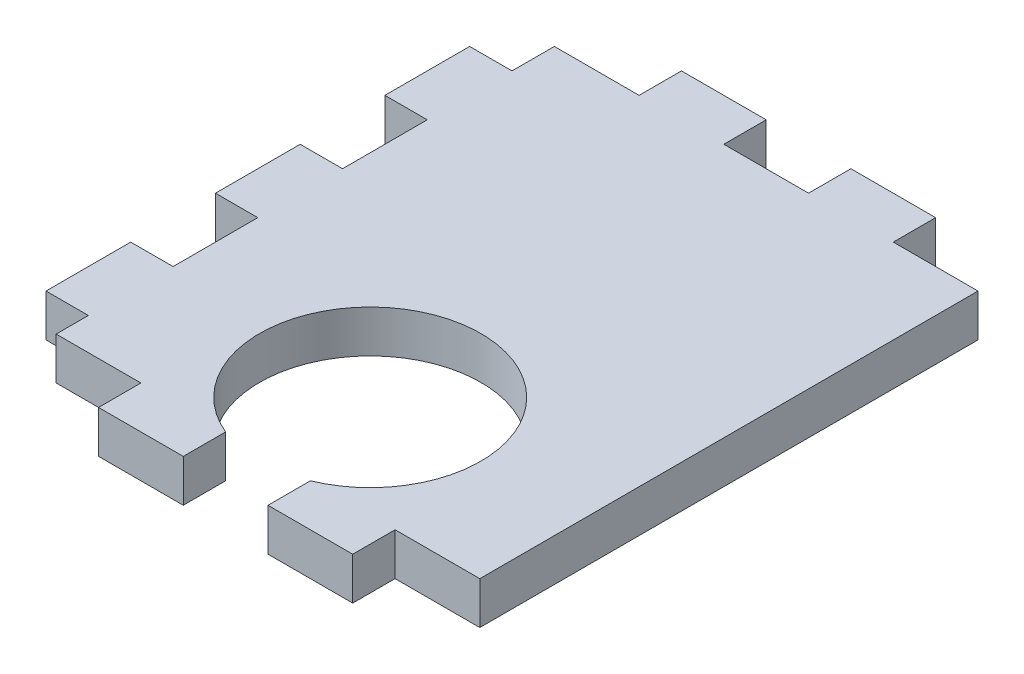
from build123d import *

# Parameters (mm, degrees)
SKETCH1_W               = 34.925
SKETCH1_H               = 43.688
BODY_DEPTH              = 3.175
SKETCH4_W               = 6.35
SKETCH4_H               = 3.175
TEETH_DEPTH             = 3.175
TEETH_PATTERN_COUNT     = 28
TEETH_PATTERN_PITCH     = 12.7
SKETCH7_W               = 1.954325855
SKETCH7_H               = 37.338
BOSS_EXTRUDE3_DEPTH     = 3.175
SKETCH5_W               = 3.175
SKETCH5_H               = 6.35
SKETCH5_H_2             = 5.588
CUT_EXTRUDE2_DEPTH      = 3.175
CUT_EXTRUDE5_DEPTH      = 57.022117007
CUT_EXTRUDE5_DEPTH_BACK = 57.022117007


with BuildPart() as part:
    # Sketch1 → body (new body)
    with BuildSketch(Plane(origin=(0, 0, 0), x_dir=(1, 0, 0), z_dir=(0, 1, 0))):
        with Locations((17.4625, 21.844)):
            Rectangle(SKETCH1_W, SKETCH1_H)
    extrude(amount=BODY_DEPTH)

    # Sketch4 → teeth (cut)
    with BuildSketch(Plane(origin=(0, 3.175, 0), x_dir=(1, 0, 0), z_dir=(0, 1, 0))):
        with Locations((6.35, 42.1005)):
            Rectangle(SKETCH4_W, SKETCH4_H)
        with Locations((6.35, 1.5875)):
            Rectangle(SKETCH4_W, SKETCH4_H)
    teeth = extrude(amount=-TEETH_DEPTH, mode=Mode.SUBTRACT)

    # teeth pattern: teeth ×28
    with Locations(*[(i * TEETH_PATTERN_PITCH, 0, 0) for i in range(1, TEETH_PATTERN_COUNT)]):
        add(teeth, mode=Mode.SUBTRACT)

    # Sketch7 → Boss-Extrude3 (add)
    with BuildSketch(Plane(origin=(0, 3.175, 0), x_dir=(1, 0, 0), z_dir=(0, 1, 0))):
        with Locations((3.098546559, 21.844)):
            Rectangle(SKETCH7_W, SKETCH7_H)
    extrude(amount=-BOSS_EXTRUDE3_DEPTH)

    # Sketch5 → Cut-Extrude2 (cut)
    with BuildSketch(Plane(origin=(0, 3.175, 0), x_dir=(1, 0, 0), z_dir=(0, 1, 0))):
        with Locations((1.5875, 40.513)):
            Rectangle(SKETCH5_W, SKETCH5_H)
        with Locations((1.5875, 27.813)):
            Rectangle(SKETCH5_W, SKETCH5_H)
        with Locations((1.5875, 15.113)):
            Rectangle(SKETCH5_W, SKETCH5_H)
        with Locations((1.5875, 2.794)):
            Rectangle(SKETCH5_W, SKETCH5_H_2)
    extrude(amount=-CUT_EXTRUDE2_DEPTH, mode=Mode.SUBTRACT)

    # Sketch8 → Cut-Extrude5 (cut, two sides: drawn at the far end of the back side and taken through both)
    with BuildSketch(Plane(origin=(0, 3.175, 0), x_dir=(1, 0, 0), z_dir=(0, 1, 0)).offset(-CUT_EXTRUDE5_DEPTH_BACK)):
        with BuildLine():
            ThreePointArc((15.875, 3.175), (19.05, 19.130166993), (22.225, 3.175))
            Line((22.225, 3.175), (15.875, 3.175))
        make_face()
    extrude(amount=CUT_EXTRUDE5_DEPTH + CUT_EXTRUDE5_DEPTH_BACK, mode=Mode.SUBTRACT)


solid = part.part
